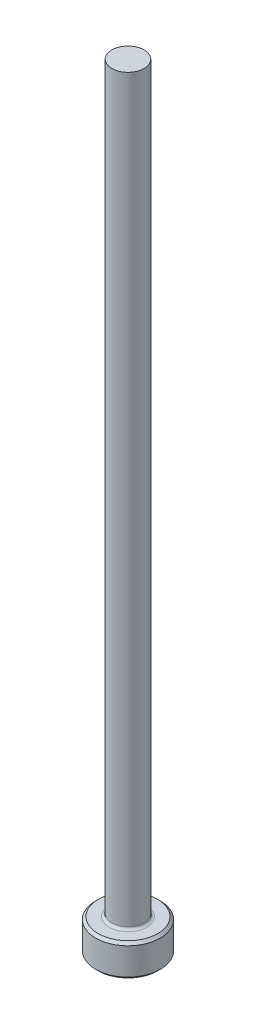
ISO-10303-21;
HEADER;
FILE_DESCRIPTION(('STEP AP214'),'2;1');
FILE_NAME('part.step','',(''),(''),'','','');
FILE_SCHEMA(('AUTOMOTIVE_DESIGN { 1 0 10303 214 1 1 1 1 }'));
ENDSEC;
DATA;
#1=APPLICATION_CONTEXT('core data for automotive mechanical design processes');
#2=APPLICATION_PROTOCOL_DEFINITION('international standard','automotive_design',2000,#1);
#3=PRODUCT_CONTEXT('',#1,'mechanical');
#4=PRODUCT('Part','Part','',(#3));
#5=PRODUCT_RELATED_PRODUCT_CATEGORY('part','',(#4));
#6=PRODUCT_DEFINITION_FORMATION('','',#4);
#7=PRODUCT_DEFINITION_CONTEXT('part definition',#1,'design');
#8=PRODUCT_DEFINITION('design','',#6,#7);
#9=PRODUCT_DEFINITION_SHAPE('','',#8);
#10=(LENGTH_UNIT() NAMED_UNIT(*) SI_UNIT(.MILLI.,.METRE.));
#11=(NAMED_UNIT(*) PLANE_ANGLE_UNIT() SI_UNIT($,.RADIAN.));
#12=(NAMED_UNIT(*) SI_UNIT($,.STERADIAN.) SOLID_ANGLE_UNIT());
#13=UNCERTAINTY_MEASURE_WITH_UNIT(LENGTH_MEASURE(1.E-05),#10,'distance_accuracy_value','');
#14=(GEOMETRIC_REPRESENTATION_CONTEXT(3) GLOBAL_UNCERTAINTY_ASSIGNED_CONTEXT((#13)) GLOBAL_UNIT_ASSIGNED_CONTEXT((#10,
#11,#12)) REPRESENTATION_CONTEXT('',''));
#15=CARTESIAN_POINT('',(0.,0.,0.));
#16=DIRECTION('',(0.,0.,1.));
#17=DIRECTION('',(1.,0.,0.));
#18=AXIS2_PLACEMENT_3D('',#15,#16,#17);
#19=CARTESIAN_POINT('',(0.,0.,0.));
#20=DIRECTION('',(0.,-1.,0.));
#21=DIRECTION('',(0.,0.,-1.));
#22=AXIS2_PLACEMENT_3D('',#19,#20,#21);
#23=PLANE('',#22);
#24=CARTESIAN_POINT('',(0.,0.,0.));
#25=DIRECTION('',(0.,-1.,0.));
#26=DIRECTION('',(0.,0.,-1.));
#27=AXIS2_PLACEMENT_3D('',#24,#25,#26);
#28=CIRCLE('',#27,2.92099999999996);
#29=CARTESIAN_POINT('',(0.,0.,-2.92099999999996));
#30=VERTEX_POINT('',#29);
#31=EDGE_CURVE('E46',#30,#30,#28,.T.);
#32=ORIENTED_EDGE('',*,*,#31,.T.);
#33=EDGE_LOOP('',(#32));
#34=FACE_BOUND('',#33,.T.);
#35=ADVANCED_FACE('F35',(#34),#23,.T.);
#36=CARTESIAN_POINT('',(0.,259.958771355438,0.));
#37=DIRECTION('',(0.,1.,0.));
#38=DIRECTION('',(0.,0.,1.));
#39=AXIS2_PLACEMENT_3D('',#36,#37,#38);
#40=CYLINDRICAL_SURFACE('',#39,3.17499999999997);
#41=CARTESIAN_POINT('',(0.,2.92099999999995,0.));
#42=DIRECTION('',(0.,1.,0.));
#43=DIRECTION('',(0.,0.,1.));
#44=AXIS2_PLACEMENT_3D('',#41,#42,#43);
#45=CIRCLE('',#44,3.17499999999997);
#46=CARTESIAN_POINT('',(0.,2.92099999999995,3.17499999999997));
#47=VERTEX_POINT('',#46);
#48=EDGE_CURVE('E50',#47,#47,#45,.F.);
#49=ORIENTED_EDGE('',*,*,#48,.T.);
#50=EDGE_LOOP('',(#49));
#51=FACE_BOUND('',#50,.T.);
#52=CARTESIAN_POINT('',(0.,0.254000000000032,0.));
#53=DIRECTION('',(0.,-1.,0.));
#54=DIRECTION('',(0.,0.,-1.));
#55=AXIS2_PLACEMENT_3D('',#52,#53,#54);
#56=CIRCLE('',#55,3.17499999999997);
#57=CARTESIAN_POINT('',(0.,0.254000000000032,-3.17499999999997));
#58=VERTEX_POINT('',#57);
#59=EDGE_CURVE('E55',#58,#58,#56,.F.);
#60=ORIENTED_EDGE('',*,*,#59,.T.);
#61=EDGE_LOOP('',(#60));
#62=FACE_BOUND('',#61,.T.);
#63=ADVANCED_FACE('F77',(#51,#62),#40,.T.);
#64=CARTESIAN_POINT('',(-3.17499999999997,3.175,0.));
#65=DIRECTION('',(0.,1.,0.));
#66=DIRECTION('',(0.,0.,1.));
#67=AXIS2_PLACEMENT_3D('',#64,#65,#66);
#68=PLANE('',#67);
#69=CARTESIAN_POINT('',(0.,3.175,0.));
#70=DIRECTION('',(0.,1.,0.));
#71=DIRECTION('',(0.,0.,1.));
#72=AXIS2_PLACEMENT_3D('',#69,#70,#71);
#73=CIRCLE('',#72,1.84149999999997);
#74=CARTESIAN_POINT('',(0.,3.175,1.84149999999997));
#75=VERTEX_POINT('',#74);
#76=EDGE_CURVE('E10',#75,#75,#73,.F.);
#77=ORIENTED_EDGE('',*,*,#76,.T.);
#78=EDGE_LOOP('',(#77));
#79=FACE_BOUND('',#78,.T.);
#80=CARTESIAN_POINT('',(0.,3.175,0.));
#81=DIRECTION('',(0.,1.,0.));
#82=DIRECTION('',(0.,0.,1.));
#83=AXIS2_PLACEMENT_3D('',#80,#81,#82);
#84=CIRCLE('',#83,2.92099999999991);
#85=CARTESIAN_POINT('',(0.,3.175,2.92099999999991));
#86=VERTEX_POINT('',#85);
#87=EDGE_CURVE('E58',#86,#86,#84,.T.);
#88=ORIENTED_EDGE('',*,*,#87,.T.);
#89=EDGE_LOOP('',(#88));
#90=FACE_BOUND('',#89,.T.);
#91=ADVANCED_FACE('F69',(#79,#90),#68,.T.);
#92=CARTESIAN_POINT('',(0.,259.958771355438,0.));
#93=DIRECTION('',(0.,1.,0.));
#94=DIRECTION('',(0.,0.,1.));
#95=AXIS2_PLACEMENT_3D('',#92,#93,#94);
#96=CYLINDRICAL_SURFACE('',#95,1.58749999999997);
#97=CARTESIAN_POINT('',(0.,3.42900000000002,0.));
#98=DIRECTION('',(0.,1.,0.));
#99=DIRECTION('',(0.,0.,1.));
#100=AXIS2_PLACEMENT_3D('',#97,#98,#99);
#101=CIRCLE('',#100,1.58749999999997);
#102=CARTESIAN_POINT('',(0.,3.42900000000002,1.58749999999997));
#103=VERTEX_POINT('',#102);
#104=EDGE_CURVE('E42',#103,#103,#101,.T.);
#105=ORIENTED_EDGE('',*,*,#104,.T.);
#106=EDGE_LOOP('',(#105));
#107=FACE_BOUND('',#106,.T.);
#108=CARTESIAN_POINT('',(0.,76.2,0.));
#109=DIRECTION('',(0.,1.,0.));
#110=DIRECTION('',(0.,0.,1.));
#111=AXIS2_PLACEMENT_3D('',#108,#109,#110);
#112=CIRCLE('',#111,1.58749999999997);
#113=CARTESIAN_POINT('',(0.,76.2,1.58749999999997));
#114=VERTEX_POINT('',#113);
#115=EDGE_CURVE('E61',#114,#114,#112,.T.);
#116=ORIENTED_EDGE('',*,*,#115,.F.);
#117=EDGE_LOOP('',(#116));
#118=FACE_BOUND('',#117,.T.);
#119=ADVANCED_FACE('F67',(#107,#118),#96,.T.);
#120=CARTESIAN_POINT('',(-1.58749999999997,76.2,0.));
#121=DIRECTION('',(0.,1.,0.));
#122=DIRECTION('',(0.,0.,1.));
#123=AXIS2_PLACEMENT_3D('',#120,#121,#122);
#124=PLANE('',#123);
#125=ORIENTED_EDGE('',*,*,#115,.T.);
#126=EDGE_LOOP('',(#125));
#127=FACE_BOUND('',#126,.T.);
#128=ADVANCED_FACE('F65',(#127),#124,.T.);
#129=CARTESIAN_POINT('',(0.,3.17499999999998,0.));
#130=DIRECTION('',(0.,-1.,0.));
#131=DIRECTION('',(0.,0.,-1.));
#132=AXIS2_PLACEMENT_3D('',#129,#130,#131);
#133=CONICAL_SURFACE('',#132,2.92099999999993,0.78539816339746);
#134=ORIENTED_EDGE('',*,*,#48,.F.);
#135=EDGE_LOOP('',(#134));
#136=FACE_BOUND('',#135,.T.);
#137=ORIENTED_EDGE('',*,*,#87,.F.);
#138=EDGE_LOOP('',(#137));
#139=FACE_BOUND('',#138,.T.);
#140=ADVANCED_FACE('F75',(#136,#139),#133,.T.);
#141=CARTESIAN_POINT('',(0.,0.254000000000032,0.));
#142=DIRECTION('',(0.,1.,0.));
#143=DIRECTION('',(0.,0.,1.));
#144=AXIS2_PLACEMENT_3D('',#141,#142,#143);
#145=CONICAL_SURFACE('',#144,3.17499999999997,0.785398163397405);
#146=ORIENTED_EDGE('',*,*,#31,.F.);
#147=EDGE_LOOP('',(#146));
#148=FACE_BOUND('',#147,.T.);
#149=ORIENTED_EDGE('',*,*,#59,.F.);
#150=EDGE_LOOP('',(#149));
#151=FACE_BOUND('',#150,.T.);
#152=ADVANCED_FACE('F89',(#148,#151),#145,.T.);
#153=CARTESIAN_POINT('',(0.,3.42900000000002,0.));
#154=DIRECTION('',(0.,1.,0.));
#155=DIRECTION('',(0.,0.,1.));
#156=AXIS2_PLACEMENT_3D('',#153,#154,#155);
#157=TOROIDAL_SURFACE('',#156,1.84149999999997,0.254);
#158=ORIENTED_EDGE('',*,*,#76,.F.);
#159=EDGE_LOOP('',(#158));
#160=FACE_BOUND('',#159,.T.);
#161=ORIENTED_EDGE('',*,*,#104,.F.);
#162=EDGE_LOOP('',(#161));
#163=FACE_BOUND('',#162,.T.);
#164=ADVANCED_FACE('F37',(#160,#163),#157,.F.);
#165=CLOSED_SHELL('',(#35,#63,#91,#119,#128,#140,#152,#164));
#166=MANIFOLD_SOLID_BREP('B2',#165);
#167=ADVANCED_BREP_SHAPE_REPRESENTATION('',(#18,#166),#14);
#168=SHAPE_DEFINITION_REPRESENTATION(#9,#167);
ENDSEC;
END-ISO-10303-21;
